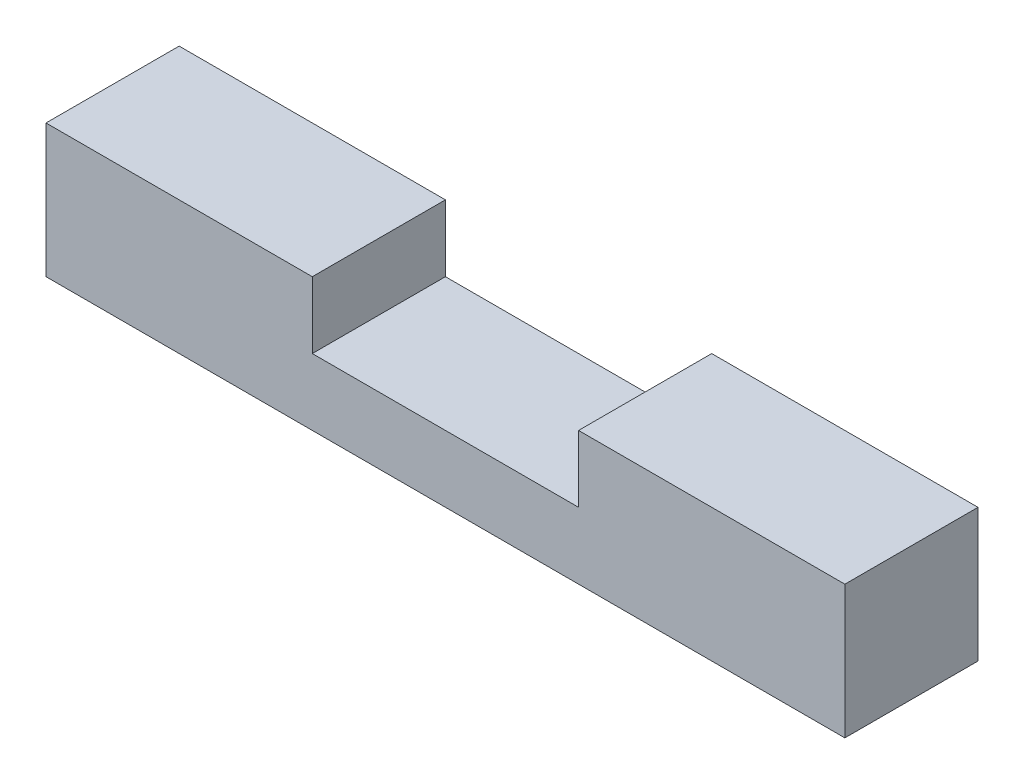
ISO-10303-21;
HEADER;
FILE_DESCRIPTION(('STEP AP214'),'2;1');
FILE_NAME('part.step','',(''),(''),'','','');
FILE_SCHEMA(('AUTOMOTIVE_DESIGN { 1 0 10303 214 1 1 1 1 }'));
ENDSEC;
DATA;
#1=APPLICATION_CONTEXT('core data for automotive mechanical design processes');
#2=APPLICATION_PROTOCOL_DEFINITION('international standard','automotive_design',2000,#1);
#3=PRODUCT_CONTEXT('',#1,'mechanical');
#4=PRODUCT('Part','Part','',(#3));
#5=PRODUCT_RELATED_PRODUCT_CATEGORY('part','',(#4));
#6=PRODUCT_DEFINITION_FORMATION('','',#4);
#7=PRODUCT_DEFINITION_CONTEXT('part definition',#1,'design');
#8=PRODUCT_DEFINITION('design','',#6,#7);
#9=PRODUCT_DEFINITION_SHAPE('','',#8);
#10=(LENGTH_UNIT() NAMED_UNIT(*) SI_UNIT(.MILLI.,.METRE.));
#11=(NAMED_UNIT(*) PLANE_ANGLE_UNIT() SI_UNIT($,.RADIAN.));
#12=(NAMED_UNIT(*) SI_UNIT($,.STERADIAN.) SOLID_ANGLE_UNIT());
#13=UNCERTAINTY_MEASURE_WITH_UNIT(LENGTH_MEASURE(1.E-05),#10,'distance_accuracy_value','');
#14=(GEOMETRIC_REPRESENTATION_CONTEXT(3) GLOBAL_UNCERTAINTY_ASSIGNED_CONTEXT((#13)) GLOBAL_UNIT_ASSIGNED_CONTEXT((#10,
#11,#12)) REPRESENTATION_CONTEXT('',''));
#15=CARTESIAN_POINT('',(0.,0.,0.));
#16=DIRECTION('',(0.,0.,1.));
#17=DIRECTION('',(1.,0.,0.));
#18=AXIS2_PLACEMENT_3D('',#15,#16,#17);
#19=CARTESIAN_POINT('',(0.,20.,-20.));
#20=DIRECTION('',(0.,-1.,0.));
#21=DIRECTION('',(0.,0.,-1.));
#22=AXIS2_PLACEMENT_3D('',#19,#20,#21);
#23=PLANE('',#22);
#24=DIRECTION('',(1.,0.,0.));
#25=VECTOR('',#24,1.);
#26=CARTESIAN_POINT('',(0.,20.,0.));
#27=LINE('',#26,#25);
#28=CARTESIAN_POINT('',(0.,20.,0.));
#29=VERTEX_POINT('',#28);
#30=CARTESIAN_POINT('',(40.,20.,0.));
#31=VERTEX_POINT('',#30);
#32=EDGE_CURVE('E84',#29,#31,#27,.T.);
#33=ORIENTED_EDGE('',*,*,#32,.T.);
#34=DIRECTION('',(0.,0.,1.));
#35=VECTOR('',#34,1.);
#36=CARTESIAN_POINT('',(40.,20.,-20.));
#37=LINE('',#36,#35);
#38=CARTESIAN_POINT('',(40.,20.,-20.));
#39=VERTEX_POINT('',#38);
#40=EDGE_CURVE('E132',#39,#31,#37,.T.);
#41=ORIENTED_EDGE('',*,*,#40,.F.);
#42=DIRECTION('',(-1.,0.,0.));
#43=VECTOR('',#42,1.);
#44=CARTESIAN_POINT('',(0.,20.,-20.));
#45=LINE('',#44,#43);
#46=CARTESIAN_POINT('',(0.,20.,-20.));
#47=VERTEX_POINT('',#46);
#48=EDGE_CURVE('E55',#39,#47,#45,.T.);
#49=ORIENTED_EDGE('',*,*,#48,.T.);
#50=DIRECTION('',(0.,0.,1.));
#51=VECTOR('',#50,1.);
#52=CARTESIAN_POINT('',(0.,20.,0.));
#53=LINE('',#52,#51);
#54=EDGE_CURVE('E138',#47,#29,#53,.T.);
#55=ORIENTED_EDGE('',*,*,#54,.T.);
#56=EDGE_LOOP('',(#33,#41,#49,#55));
#57=FACE_BOUND('',#56,.T.);
#58=ADVANCED_FACE('F31',(#57),#23,.F.);
#59=CARTESIAN_POINT('',(0.,20.,0.));
#60=DIRECTION('',(1.,0.,0.));
#61=DIRECTION('',(0.,0.,-1.));
#62=AXIS2_PLACEMENT_3D('',#59,#60,#61);
#63=PLANE('',#62);
#64=DIRECTION('',(0.,0.,1.));
#65=VECTOR('',#64,1.);
#66=CARTESIAN_POINT('',(0.,0.,0.));
#67=LINE('',#66,#65);
#68=CARTESIAN_POINT('',(0.,0.,-20.));
#69=VERTEX_POINT('',#68);
#70=CARTESIAN_POINT('',(0.,0.,0.));
#71=VERTEX_POINT('',#70);
#72=EDGE_CURVE('E134',#69,#71,#67,.T.);
#73=ORIENTED_EDGE('',*,*,#72,.T.);
#74=DIRECTION('',(0.,-1.,0.));
#75=VECTOR('',#74,1.);
#76=CARTESIAN_POINT('',(0.,20.,0.));
#77=LINE('',#76,#75);
#78=EDGE_CURVE('E11',#29,#71,#77,.T.);
#79=ORIENTED_EDGE('',*,*,#78,.F.);
#80=ORIENTED_EDGE('',*,*,#54,.F.);
#81=DIRECTION('',(0.,-1.,0.));
#82=VECTOR('',#81,1.);
#83=CARTESIAN_POINT('',(0.,20.,-20.));
#84=LINE('',#83,#82);
#85=EDGE_CURVE('E147',#47,#69,#84,.T.);
#86=ORIENTED_EDGE('',*,*,#85,.T.);
#87=EDGE_LOOP('',(#73,#79,#80,#86));
#88=FACE_BOUND('',#87,.T.);
#89=ADVANCED_FACE('F33',(#88),#63,.F.);
#90=CARTESIAN_POINT('',(0.,20.,0.));
#91=DIRECTION('',(0.,0.,-1.));
#92=DIRECTION('',(-1.,0.,0.));
#93=AXIS2_PLACEMENT_3D('',#90,#91,#92);
#94=PLANE('',#93);
#95=DIRECTION('',(1.,0.,0.));
#96=VECTOR('',#95,1.);
#97=CARTESIAN_POINT('',(40.,10.,0.));
#98=LINE('',#97,#96);
#99=CARTESIAN_POINT('',(40.,10.,0.));
#100=VERTEX_POINT('',#99);
#101=CARTESIAN_POINT('',(80.,10.,0.));
#102=VERTEX_POINT('',#101);
#103=EDGE_CURVE('E126',#100,#102,#98,.T.);
#104=ORIENTED_EDGE('',*,*,#103,.F.);
#105=DIRECTION('',(0.,-1.,0.));
#106=VECTOR('',#105,1.);
#107=CARTESIAN_POINT('',(40.,20.,0.));
#108=LINE('',#107,#106);
#109=EDGE_CURVE('E111',#31,#100,#108,.T.);
#110=ORIENTED_EDGE('',*,*,#109,.F.);
#111=ORIENTED_EDGE('',*,*,#32,.F.);
#112=ORIENTED_EDGE('',*,*,#78,.T.);
#113=DIRECTION('',(1.,0.,0.));
#114=VECTOR('',#113,1.);
#115=CARTESIAN_POINT('',(0.,0.,0.));
#116=LINE('',#115,#114);
#117=CARTESIAN_POINT('',(120.,0.,0.));
#118=VERTEX_POINT('',#117);
#119=EDGE_CURVE('E150',#71,#118,#116,.T.);
#120=ORIENTED_EDGE('',*,*,#119,.T.);
#121=DIRECTION('',(0.,-1.,0.));
#122=VECTOR('',#121,1.);
#123=CARTESIAN_POINT('',(120.,20.,0.));
#124=LINE('',#123,#122);
#125=CARTESIAN_POINT('',(120.,20.,0.));
#126=VERTEX_POINT('',#125);
#127=EDGE_CURVE('E39',#126,#118,#124,.T.);
#128=ORIENTED_EDGE('',*,*,#127,.F.);
#129=CARTESIAN_POINT('',(80.,20.,0.));
#130=VERTEX_POINT('',#129);
#131=EDGE_CURVE('E140',#130,#126,#27,.T.);
#132=ORIENTED_EDGE('',*,*,#131,.F.);
#133=DIRECTION('',(0.,1.,0.));
#134=VECTOR('',#133,1.);
#135=CARTESIAN_POINT('',(80.,20.,0.));
#136=LINE('',#135,#134);
#137=EDGE_CURVE('E46',#102,#130,#136,.T.);
#138=ORIENTED_EDGE('',*,*,#137,.F.);
#139=EDGE_LOOP('',(#104,#110,#111,#112,#120,#128,#132,#138));
#140=FACE_BOUND('',#139,.T.);
#141=ADVANCED_FACE('F171',(#140),#94,.F.);
#142=CARTESIAN_POINT('',(120.,20.,0.));
#143=DIRECTION('',(-1.,0.,0.));
#144=DIRECTION('',(0.,0.,1.));
#145=AXIS2_PLACEMENT_3D('',#142,#143,#144);
#146=PLANE('',#145);
#147=DIRECTION('',(0.,0.,-1.));
#148=VECTOR('',#147,1.);
#149=CARTESIAN_POINT('',(120.,0.,0.));
#150=LINE('',#149,#148);
#151=CARTESIAN_POINT('',(120.,0.,-20.));
#152=VERTEX_POINT('',#151);
#153=EDGE_CURVE('E152',#118,#152,#150,.T.);
#154=ORIENTED_EDGE('',*,*,#153,.T.);
#155=DIRECTION('',(0.,-1.,0.));
#156=VECTOR('',#155,1.);
#157=CARTESIAN_POINT('',(120.,20.,-20.));
#158=LINE('',#157,#156);
#159=CARTESIAN_POINT('',(120.,20.,-20.));
#160=VERTEX_POINT('',#159);
#161=EDGE_CURVE('E156',#160,#152,#158,.T.);
#162=ORIENTED_EDGE('',*,*,#161,.F.);
#163=DIRECTION('',(0.,0.,-1.));
#164=VECTOR('',#163,1.);
#165=CARTESIAN_POINT('',(120.,20.,0.));
#166=LINE('',#165,#164);
#167=EDGE_CURVE('E142',#126,#160,#166,.T.);
#168=ORIENTED_EDGE('',*,*,#167,.F.);
#169=ORIENTED_EDGE('',*,*,#127,.T.);
#170=EDGE_LOOP('',(#154,#162,#168,#169));
#171=FACE_BOUND('',#170,.T.);
#172=ADVANCED_FACE('F162',(#171),#146,.F.);
#173=CARTESIAN_POINT('',(0.,20.,-20.));
#174=DIRECTION('',(0.,0.,1.));
#175=DIRECTION('',(1.,0.,0.));
#176=AXIS2_PLACEMENT_3D('',#173,#174,#175);
#177=PLANE('',#176);
#178=ORIENTED_EDGE('',*,*,#48,.F.);
#179=DIRECTION('',(0.,-1.,0.));
#180=VECTOR('',#179,1.);
#181=CARTESIAN_POINT('',(40.,20.,-20.));
#182=LINE('',#181,#180);
#183=CARTESIAN_POINT('',(40.,10.,-20.));
#184=VERTEX_POINT('',#183);
#185=EDGE_CURVE('E110',#39,#184,#182,.T.);
#186=ORIENTED_EDGE('',*,*,#185,.T.);
#187=DIRECTION('',(1.,0.,0.));
#188=VECTOR('',#187,1.);
#189=CARTESIAN_POINT('',(40.,10.,-20.));
#190=LINE('',#189,#188);
#191=CARTESIAN_POINT('',(80.,10.,-20.));
#192=VERTEX_POINT('',#191);
#193=EDGE_CURVE('E119',#184,#192,#190,.T.);
#194=ORIENTED_EDGE('',*,*,#193,.T.);
#195=DIRECTION('',(0.,1.,0.));
#196=VECTOR('',#195,1.);
#197=CARTESIAN_POINT('',(80.,20.,-20.));
#198=LINE('',#197,#196);
#199=CARTESIAN_POINT('',(80.,20.,-20.));
#200=VERTEX_POINT('',#199);
#201=EDGE_CURVE('E116',#192,#200,#198,.T.);
#202=ORIENTED_EDGE('',*,*,#201,.T.);
#203=EDGE_CURVE('E144',#160,#200,#45,.T.);
#204=ORIENTED_EDGE('',*,*,#203,.F.);
#205=ORIENTED_EDGE('',*,*,#161,.T.);
#206=DIRECTION('',(-1.,0.,0.));
#207=VECTOR('',#206,1.);
#208=CARTESIAN_POINT('',(0.,0.,-20.));
#209=LINE('',#208,#207);
#210=EDGE_CURVE('E77',#152,#69,#209,.T.);
#211=ORIENTED_EDGE('',*,*,#210,.T.);
#212=ORIENTED_EDGE('',*,*,#85,.F.);
#213=EDGE_LOOP('',(#178,#186,#194,#202,#204,#205,#211,#212));
#214=FACE_BOUND('',#213,.T.);
#215=ADVANCED_FACE('F124',(#214),#177,.F.);
#216=ORIENTED_EDGE('',*,*,#203,.T.);
#217=DIRECTION('',(0.,0.,1.));
#218=VECTOR('',#217,1.);
#219=CARTESIAN_POINT('',(80.,20.,-20.));
#220=LINE('',#219,#218);
#221=EDGE_CURVE('E135',#200,#130,#220,.T.);
#222=ORIENTED_EDGE('',*,*,#221,.T.);
#223=ORIENTED_EDGE('',*,*,#131,.T.);
#224=ORIENTED_EDGE('',*,*,#167,.T.);
#225=EDGE_LOOP('',(#216,#222,#223,#224));
#226=FACE_BOUND('',#225,.T.);
#227=ADVANCED_FACE('F173',(#226),#23,.F.);
#228=CARTESIAN_POINT('',(0.,0.,-20.));
#229=DIRECTION('',(0.,-1.,0.));
#230=DIRECTION('',(0.,0.,-1.));
#231=AXIS2_PLACEMENT_3D('',#228,#229,#230);
#232=PLANE('',#231);
#233=ORIENTED_EDGE('',*,*,#72,.F.);
#234=ORIENTED_EDGE('',*,*,#210,.F.);
#235=ORIENTED_EDGE('',*,*,#153,.F.);
#236=ORIENTED_EDGE('',*,*,#119,.F.);
#237=EDGE_LOOP('',(#233,#234,#235,#236));
#238=FACE_BOUND('',#237,.T.);
#239=ADVANCED_FACE('F167',(#238),#232,.T.);
#240=CARTESIAN_POINT('',(40.,20.,-20.));
#241=DIRECTION('',(-1.,0.,0.));
#242=DIRECTION('',(0.,-1.,0.));
#243=AXIS2_PLACEMENT_3D('',#240,#241,#242);
#244=PLANE('',#243);
#245=ORIENTED_EDGE('',*,*,#109,.T.);
#246=DIRECTION('',(0.,0.,1.));
#247=VECTOR('',#246,1.);
#248=CARTESIAN_POINT('',(40.,10.,-20.));
#249=LINE('',#248,#247);
#250=EDGE_CURVE('E106',#184,#100,#249,.T.);
#251=ORIENTED_EDGE('',*,*,#250,.F.);
#252=ORIENTED_EDGE('',*,*,#185,.F.);
#253=ORIENTED_EDGE('',*,*,#40,.T.);
#254=EDGE_LOOP('',(#245,#251,#252,#253));
#255=FACE_BOUND('',#254,.T.);
#256=ADVANCED_FACE('F108',(#255),#244,.F.);
#257=CARTESIAN_POINT('',(80.,20.,-20.));
#258=DIRECTION('',(1.,0.,0.));
#259=DIRECTION('',(0.,0.,-1.));
#260=AXIS2_PLACEMENT_3D('',#257,#258,#259);
#261=PLANE('',#260);
#262=ORIENTED_EDGE('',*,*,#137,.T.);
#263=ORIENTED_EDGE('',*,*,#221,.F.);
#264=ORIENTED_EDGE('',*,*,#201,.F.);
#265=DIRECTION('',(0.,0.,1.));
#266=VECTOR('',#265,1.);
#267=CARTESIAN_POINT('',(80.,10.,-20.));
#268=LINE('',#267,#266);
#269=EDGE_CURVE('E115',#192,#102,#268,.T.);
#270=ORIENTED_EDGE('',*,*,#269,.T.);
#271=EDGE_LOOP('',(#262,#263,#264,#270));
#272=FACE_BOUND('',#271,.T.);
#273=ADVANCED_FACE('F175',(#272),#261,.F.);
#274=CARTESIAN_POINT('',(40.,10.,-20.));
#275=DIRECTION('',(0.,-1.,0.));
#276=DIRECTION('',(0.,0.,-1.));
#277=AXIS2_PLACEMENT_3D('',#274,#275,#276);
#278=PLANE('',#277);
#279=ORIENTED_EDGE('',*,*,#103,.T.);
#280=ORIENTED_EDGE('',*,*,#269,.F.);
#281=ORIENTED_EDGE('',*,*,#193,.F.);
#282=ORIENTED_EDGE('',*,*,#250,.T.);
#283=EDGE_LOOP('',(#279,#280,#281,#282));
#284=FACE_BOUND('',#283,.T.);
#285=ADVANCED_FACE('F120',(#284),#278,.F.);
#286=CLOSED_SHELL('',(#58,#89,#141,#172,#215,#227,#239,#256,#273,#285));
#287=MANIFOLD_SOLID_BREP('B2',#286);
#288=ADVANCED_BREP_SHAPE_REPRESENTATION('',(#18,#287),#14);
#289=SHAPE_DEFINITION_REPRESENTATION(#9,#288);
ENDSEC;
END-ISO-10303-21;
